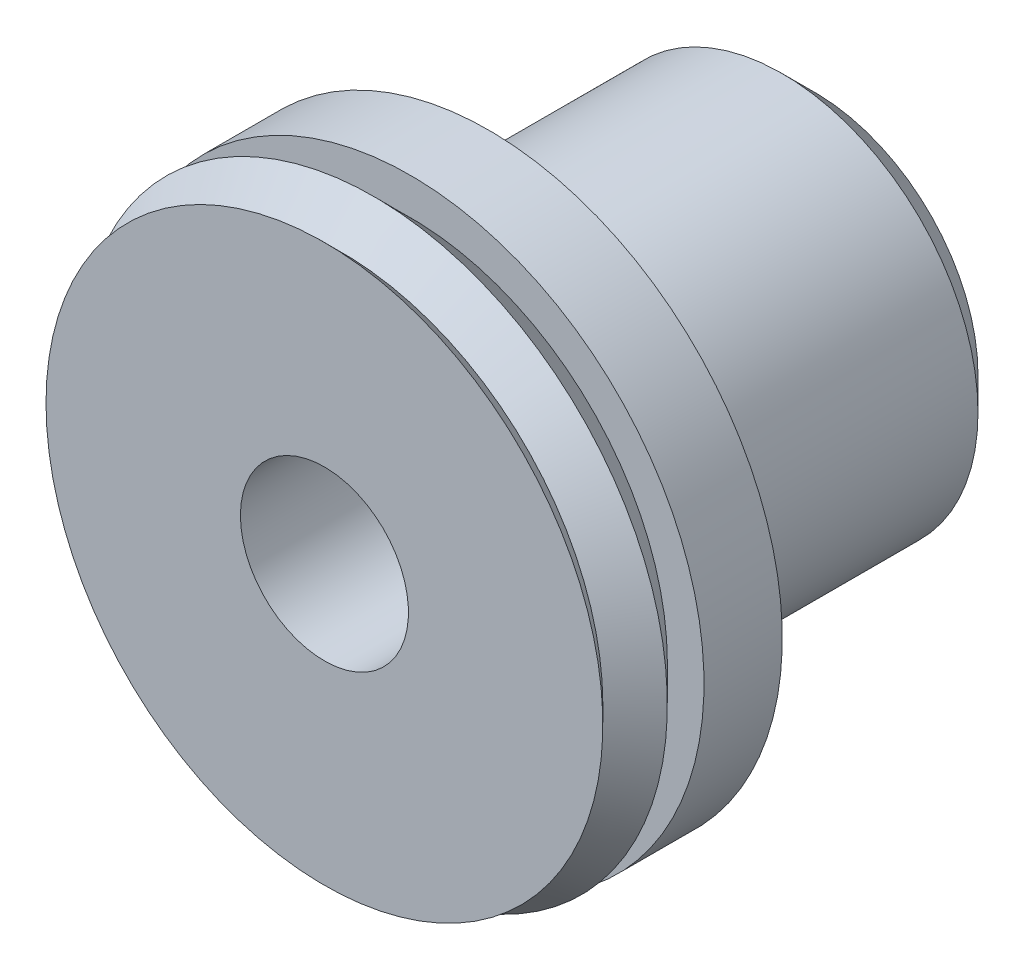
ISO-10303-21;
HEADER;
FILE_DESCRIPTION(('STEP AP214'),'2;1');
FILE_NAME('part.step','',(''),(''),'','','');
FILE_SCHEMA(('AUTOMOTIVE_DESIGN { 1 0 10303 214 1 1 1 1 }'));
ENDSEC;
DATA;
#1=APPLICATION_CONTEXT('core data for automotive mechanical design processes');
#2=APPLICATION_PROTOCOL_DEFINITION('international standard','automotive_design',2000,#1);
#3=PRODUCT_CONTEXT('',#1,'mechanical');
#4=PRODUCT('Part','Part','',(#3));
#5=PRODUCT_RELATED_PRODUCT_CATEGORY('part','',(#4));
#6=PRODUCT_DEFINITION_FORMATION('','',#4);
#7=PRODUCT_DEFINITION_CONTEXT('part definition',#1,'design');
#8=PRODUCT_DEFINITION('design','',#6,#7);
#9=PRODUCT_DEFINITION_SHAPE('','',#8);
#10=(LENGTH_UNIT() NAMED_UNIT(*) SI_UNIT(.MILLI.,.METRE.));
#11=(NAMED_UNIT(*) PLANE_ANGLE_UNIT() SI_UNIT($,.RADIAN.));
#12=(NAMED_UNIT(*) SI_UNIT($,.STERADIAN.) SOLID_ANGLE_UNIT());
#13=UNCERTAINTY_MEASURE_WITH_UNIT(LENGTH_MEASURE(1.E-05),#10,'distance_accuracy_value','');
#14=(GEOMETRIC_REPRESENTATION_CONTEXT(3) GLOBAL_UNCERTAINTY_ASSIGNED_CONTEXT((#13)) GLOBAL_UNIT_ASSIGNED_CONTEXT((#10,
#11,#12)) REPRESENTATION_CONTEXT('',''));
#15=CARTESIAN_POINT('',(0.,0.,0.));
#16=DIRECTION('',(0.,0.,1.));
#17=DIRECTION('',(1.,0.,0.));
#18=AXIS2_PLACEMENT_3D('',#15,#16,#17);
#19=CARTESIAN_POINT('',(0.,0.,0.));
#20=DIRECTION('',(0.,0.,1.));
#21=DIRECTION('',(1.,0.,0.));
#22=AXIS2_PLACEMENT_3D('',#19,#20,#21);
#23=PLANE('',#22);
#24=CARTESIAN_POINT('',(0.,0.,0.));
#25=DIRECTION('',(0.,0.,-1.));
#26=DIRECTION('',(-1.,0.,0.));
#27=AXIS2_PLACEMENT_3D('',#24,#25,#26);
#28=CIRCLE('',#27,6.77545);
#29=CARTESIAN_POINT('',(-6.77545,0.,0.));
#30=VERTEX_POINT('',#29);
#31=EDGE_CURVE('E48',#30,#30,#28,.T.);
#32=ORIENTED_EDGE('',*,*,#31,.F.);
#33=EDGE_LOOP('',(#32));
#34=FACE_BOUND('',#33,.T.);
#35=CARTESIAN_POINT('',(0.,0.,0.));
#36=DIRECTION('',(0.,0.,-1.));
#37=DIRECTION('',(-1.,0.,0.));
#38=AXIS2_PLACEMENT_3D('',#35,#36,#37);
#39=CIRCLE('',#38,2.0447);
#40=CARTESIAN_POINT('',(-2.0447,0.,0.));
#41=VERTEX_POINT('',#40);
#42=EDGE_CURVE('E69',#41,#41,#39,.T.);
#43=ORIENTED_EDGE('',*,*,#42,.T.);
#44=EDGE_LOOP('',(#43));
#45=FACE_BOUND('',#44,.T.);
#46=ADVANCED_FACE('F33',(#34,#45),#23,.T.);
#47=CARTESIAN_POINT('',(0.,0.,-11.935714));
#48=DIRECTION('',(0.,0.,1.));
#49=DIRECTION('',(1.,0.,0.));
#50=AXIS2_PLACEMENT_3D('',#47,#48,#49);
#51=PLANE('',#50);
#52=CARTESIAN_POINT('',(0.,0.,-11.935714));
#53=DIRECTION('',(0.,0.,1.));
#54=DIRECTION('',(1.,0.,0.));
#55=AXIS2_PLACEMENT_3D('',#52,#53,#54);
#56=CIRCLE('',#55,3.96875);
#57=CARTESIAN_POINT('',(3.96875,0.,-11.935714));
#58=VERTEX_POINT('',#57);
#59=EDGE_CURVE('E10',#58,#58,#56,.F.);
#60=ORIENTED_EDGE('',*,*,#59,.T.);
#61=EDGE_LOOP('',(#60));
#62=FACE_BOUND('',#61,.T.);
#63=CARTESIAN_POINT('',(0.,0.,-11.935714));
#64=DIRECTION('',(0.,0.,-1.));
#65=DIRECTION('',(-1.,0.,0.));
#66=AXIS2_PLACEMENT_3D('',#63,#64,#65);
#67=CIRCLE('',#66,2.0447);
#68=CARTESIAN_POINT('',(-2.0447,0.,-11.935714));
#69=VERTEX_POINT('',#68);
#70=EDGE_CURVE('E68',#69,#69,#67,.T.);
#71=ORIENTED_EDGE('',*,*,#70,.F.);
#72=EDGE_LOOP('',(#71));
#73=FACE_BOUND('',#72,.T.);
#74=ADVANCED_FACE('F78',(#62,#73),#51,.F.);
#75=CARTESIAN_POINT('',(0.,0.,-0.416559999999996));
#76=DIRECTION('',(0.,0.,1.));
#77=DIRECTION('',(1.,0.,0.));
#78=AXIS2_PLACEMENT_3D('',#75,#76,#77);
#79=CONICAL_SURFACE('',#78,6.35889,0.785398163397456);
#80=ORIENTED_EDGE('',*,*,#31,.T.);
#81=EDGE_LOOP('',(#80));
#82=FACE_BOUND('',#81,.T.);
#83=CARTESIAN_POINT('',(0.,0.,-0.416559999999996));
#84=DIRECTION('',(0.,0.,-1.));
#85=DIRECTION('',(-1.,0.,0.));
#86=AXIS2_PLACEMENT_3D('',#83,#84,#85);
#87=CIRCLE('',#86,6.35889);
#88=CARTESIAN_POINT('',(-6.35889,0.,-0.416559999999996));
#89=VERTEX_POINT('',#88);
#90=EDGE_CURVE('E53',#89,#89,#87,.T.);
#91=ORIENTED_EDGE('',*,*,#90,.F.);
#92=EDGE_LOOP('',(#91));
#93=FACE_BOUND('',#92,.T.);
#94=ADVANCED_FACE('F80',(#82,#93),#79,.T.);
#95=CARTESIAN_POINT('',(0.,0.,-1.20141999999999));
#96=DIRECTION('',(0.,0.,-1.));
#97=DIRECTION('',(-1.,0.,0.));
#98=AXIS2_PLACEMENT_3D('',#95,#96,#97);
#99=CONICAL_SURFACE('',#98,7.14374999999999,0.785398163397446);
#100=ORIENTED_EDGE('',*,*,#90,.T.);
#101=EDGE_LOOP('',(#100));
#102=FACE_BOUND('',#101,.T.);
#103=CARTESIAN_POINT('',(0.,0.,-1.20141999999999));
#104=DIRECTION('',(0.,0.,-1.));
#105=DIRECTION('',(-1.,0.,0.));
#106=AXIS2_PLACEMENT_3D('',#103,#104,#105);
#107=CIRCLE('',#106,7.14374999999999);
#108=CARTESIAN_POINT('',(-7.14374999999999,0.,-1.20141999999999));
#109=VERTEX_POINT('',#108);
#110=EDGE_CURVE('E56',#109,#109,#107,.T.);
#111=ORIENTED_EDGE('',*,*,#110,.F.);
#112=EDGE_LOOP('',(#111));
#113=FACE_BOUND('',#112,.T.);
#114=ADVANCED_FACE('F86',(#102,#113),#99,.T.);
#115=CARTESIAN_POINT('',(0.,0.,-2.093214));
#116=DIRECTION('',(0.,0.,1.));
#117=DIRECTION('',(1.,0.,0.));
#118=AXIS2_PLACEMENT_3D('',#115,#116,#117);
#119=CONICAL_SURFACE('',#118,6.25195599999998,0.785398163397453);
#120=ORIENTED_EDGE('',*,*,#110,.T.);
#121=EDGE_LOOP('',(#120));
#122=FACE_BOUND('',#121,.T.);
#123=CARTESIAN_POINT('',(0.,0.,-2.093214));
#124=DIRECTION('',(0.,0.,-1.));
#125=DIRECTION('',(-1.,0.,0.));
#126=AXIS2_PLACEMENT_3D('',#123,#124,#125);
#127=CIRCLE('',#126,6.25195599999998);
#128=CARTESIAN_POINT('',(-6.25195599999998,0.,-2.093214));
#129=VERTEX_POINT('',#128);
#130=EDGE_CURVE('E59',#129,#129,#127,.T.);
#131=ORIENTED_EDGE('',*,*,#130,.F.);
#132=EDGE_LOOP('',(#131));
#133=FACE_BOUND('',#132,.T.);
#134=ADVANCED_FACE('F106',(#122,#133),#119,.T.);
#135=CARTESIAN_POINT('',(0.,6.25195599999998,-2.093214));
#136=DIRECTION('',(0.,0.,1.));
#137=DIRECTION('',(1.,0.,0.));
#138=AXIS2_PLACEMENT_3D('',#135,#136,#137);
#139=PLANE('',#138);
#140=ORIENTED_EDGE('',*,*,#130,.T.);
#141=EDGE_LOOP('',(#140));
#142=FACE_BOUND('',#141,.T.);
#143=CARTESIAN_POINT('',(0.,0.,-2.093214));
#144=DIRECTION('',(0.,0.,-1.));
#145=DIRECTION('',(-1.,0.,0.));
#146=AXIS2_PLACEMENT_3D('',#143,#144,#145);
#147=CIRCLE('',#146,7.14374999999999);
#148=CARTESIAN_POINT('',(-7.14374999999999,0.,-2.093214));
#149=VERTEX_POINT('',#148);
#150=EDGE_CURVE('E62',#149,#149,#147,.T.);
#151=ORIENTED_EDGE('',*,*,#150,.F.);
#152=EDGE_LOOP('',(#151));
#153=FACE_BOUND('',#152,.T.);
#154=ADVANCED_FACE('F102',(#142,#153),#139,.T.);
#155=CARTESIAN_POINT('',(0.,0.,-71.2941240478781));
#156=DIRECTION('',(0.,0.,-1.));
#157=DIRECTION('',(-1.,0.,0.));
#158=AXIS2_PLACEMENT_3D('',#155,#156,#157);
#159=CYLINDRICAL_SURFACE('',#158,7.14374999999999);
#160=ORIENTED_EDGE('',*,*,#150,.T.);
#161=EDGE_LOOP('',(#160));
#162=FACE_BOUND('',#161,.T.);
#163=CARTESIAN_POINT('',(0.,0.,-3.998214));
#164=DIRECTION('',(0.,0.,-1.));
#165=DIRECTION('',(-1.,0.,0.));
#166=AXIS2_PLACEMENT_3D('',#163,#164,#165);
#167=CIRCLE('',#166,7.14374999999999);
#168=CARTESIAN_POINT('',(-7.14374999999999,0.,-3.998214));
#169=VERTEX_POINT('',#168);
#170=EDGE_CURVE('E65',#169,#169,#167,.T.);
#171=ORIENTED_EDGE('',*,*,#170,.F.);
#172=EDGE_LOOP('',(#171));
#173=FACE_BOUND('',#172,.T.);
#174=ADVANCED_FACE('F98',(#162,#173),#159,.T.);
#175=CARTESIAN_POINT('',(0.,7.14374999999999,-3.998214));
#176=DIRECTION('',(0.,0.,-1.));
#177=DIRECTION('',(-1.,0.,0.));
#178=AXIS2_PLACEMENT_3D('',#175,#176,#177);
#179=PLANE('',#178);
#180=CARTESIAN_POINT('',(0.,0.,-3.998214));
#181=DIRECTION('',(0.,0.,-1.));
#182=DIRECTION('',(-1.,0.,0.));
#183=AXIS2_PLACEMENT_3D('',#180,#181,#182);
#184=CIRCLE('',#183,4.7625);
#185=CARTESIAN_POINT('',(-4.7625,0.,-3.998214));
#186=VERTEX_POINT('',#185);
#187=EDGE_CURVE('E44',#186,#186,#184,.T.);
#188=ORIENTED_EDGE('',*,*,#187,.F.);
#189=EDGE_LOOP('',(#188));
#190=FACE_BOUND('',#189,.T.);
#191=ORIENTED_EDGE('',*,*,#170,.T.);
#192=EDGE_LOOP('',(#191));
#193=FACE_BOUND('',#192,.T.);
#194=ADVANCED_FACE('F95',(#190,#193),#179,.T.);
#195=CARTESIAN_POINT('',(0.,0.,-11.935714));
#196=DIRECTION('',(0.,0.,1.));
#197=DIRECTION('',(1.,0.,0.));
#198=AXIS2_PLACEMENT_3D('',#195,#196,#197);
#199=CYLINDRICAL_SURFACE('',#198,4.7625);
#200=CARTESIAN_POINT('',(0.,0.,-11.141964));
#201=DIRECTION('',(0.,0.,1.));
#202=DIRECTION('',(1.,0.,0.));
#203=AXIS2_PLACEMENT_3D('',#200,#201,#202);
#204=CIRCLE('',#203,4.7625);
#205=CARTESIAN_POINT('',(4.7625,0.,-11.141964));
#206=VERTEX_POINT('',#205);
#207=EDGE_CURVE('E40',#206,#206,#204,.T.);
#208=ORIENTED_EDGE('',*,*,#207,.T.);
#209=EDGE_LOOP('',(#208));
#210=FACE_BOUND('',#209,.T.);
#211=ORIENTED_EDGE('',*,*,#187,.T.);
#212=EDGE_LOOP('',(#211));
#213=FACE_BOUND('',#212,.T.);
#214=ADVANCED_FACE('F92',(#210,#213),#199,.T.);
#215=CARTESIAN_POINT('',(0.,0.,-11.141964));
#216=DIRECTION('',(0.,0.,1.));
#217=DIRECTION('',(1.,0.,0.));
#218=AXIS2_PLACEMENT_3D('',#215,#216,#217);
#219=CONICAL_SURFACE('',#218,4.7625,0.785398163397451);
#220=ORIENTED_EDGE('',*,*,#59,.F.);
#221=EDGE_LOOP('',(#220));
#222=FACE_BOUND('',#221,.T.);
#223=ORIENTED_EDGE('',*,*,#207,.F.);
#224=EDGE_LOOP('',(#223));
#225=FACE_BOUND('',#224,.T.);
#226=ADVANCED_FACE('F35',(#222,#225),#219,.T.);
#227=CARTESIAN_POINT('',(0.,0.,-11.935714));
#228=DIRECTION('',(0.,0.,1.));
#229=DIRECTION('',(1.,0.,0.));
#230=AXIS2_PLACEMENT_3D('',#227,#228,#229);
#231=CYLINDRICAL_SURFACE('',#230,2.0447);
#232=ORIENTED_EDGE('',*,*,#70,.T.);
#233=EDGE_LOOP('',(#232));
#234=FACE_BOUND('',#233,.T.);
#235=ORIENTED_EDGE('',*,*,#42,.F.);
#236=EDGE_LOOP('',(#235));
#237=FACE_BOUND('',#236,.T.);
#238=ADVANCED_FACE('F75',(#234,#237),#231,.F.);
#239=CLOSED_SHELL('',(#46,#74,#94,#114,#134,#154,#174,#194,#214,#226,#238));
#240=MANIFOLD_SOLID_BREP('B2',#239);
#241=ADVANCED_BREP_SHAPE_REPRESENTATION('',(#18,#240),#14);
#242=SHAPE_DEFINITION_REPRESENTATION(#9,#241);
ENDSEC;
END-ISO-10303-21;
